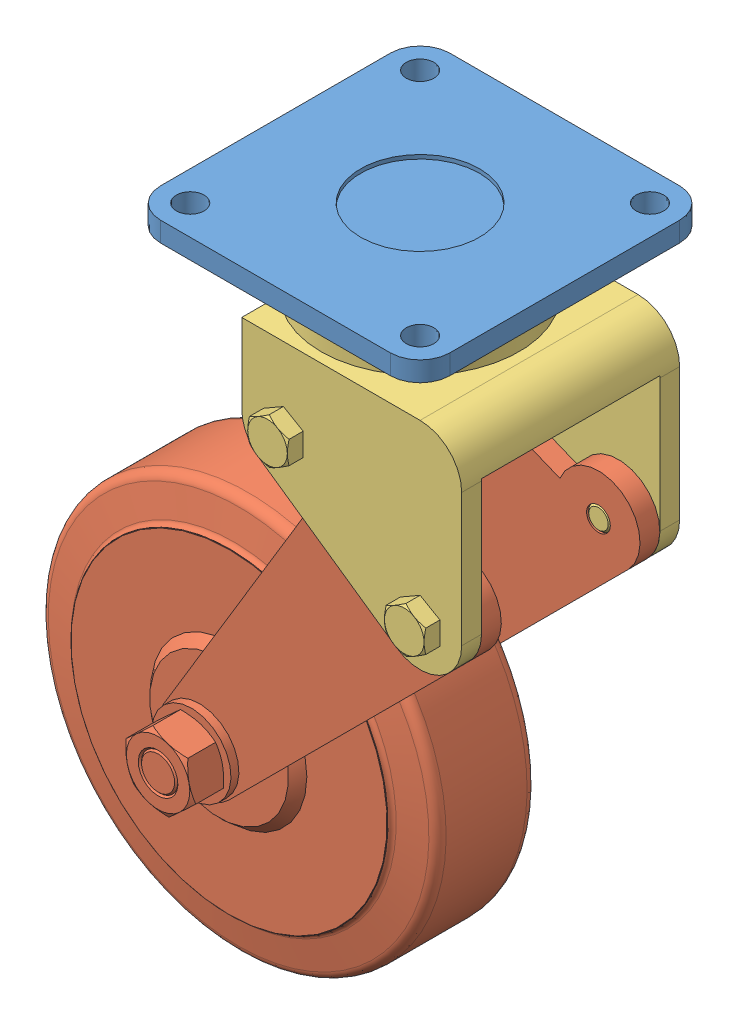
SolidWorks assembly NOUVELLE ROULETTE AV.SLDASM, configuration Default (file format 7000). Lengths in mm.
Overall size (154.67 184.42 73).
3 component instances, 3 part files, 5 mates.
Components (placement in the parent):
- SUPPORT FIXATION ROULETTE AV-1: SUPPORT FIXATION ROULETTE AV.SLDPRT [Default] at origin size (73 20 73)
- NOUVEAU CORPS ROULETTE AV-1: NOUVEAU CORPS ROULETTE AV.SLDPRT [Default] at (-13.3044 -7.5442 0) x (0.975896 0.218238 0) z (0 0 1) size (133 113.99 65.8)
- SELLETTE ROULETTE AV-1: SELLETTE ROULETTE AV.SLDPRT [Default] at origin size (65.5 68.5 63)
Mates (geometry in assembly coordinates):
- Coaxiale1: concentric: cylinder of SUPPORT FIXATION ROULETTE AV-1 through (0 -5 0) axis (0 -1 0) radius 20; cylinder of SELLETTE ROULETTE AV-1 through (0 -6 0) axis (0 -1 0) radius 20
- Coïncidente1: coincident anti-aligned: plane of SUPPORT FIXATION ROULETTE AV-1 through (0 -20 0) normal (0 -1 0); plane of SELLETTE ROULETTE AV-1 through (-17.5 -20 27.5) normal (0 1 0)
- Coïncidente2: coincident: plane of NOUVEAU CORPS ROULETTE AV-1 through (27.5 -64 22.5) normal (0 0 1); plane of SELLETTE ROULETTE AV-1 through (39 -52.75 22.5) normal (0 0 -1)
- Coaxiale2: concentric: cylinder of NOUVEAU CORPS ROULETTE AV-1 through (27.5 -64 0) axis (0 0 1) radius 3; cylinder of SELLETTE ROULETTE AV-1 through (27.5 -64 27.5) axis (0 0 1) radius 3
- Angle1: planar angle = 0.785398 rad aligned: plane of SELLETTE ROULETTE AV-1 through (38 -64 27.5) normal (1 0 0); plane of NOUVEAU CORPS ROULETTE AV-1 through (-25.7888 -132.1381 22.5) normal (0.707107 -0.707107 0)
